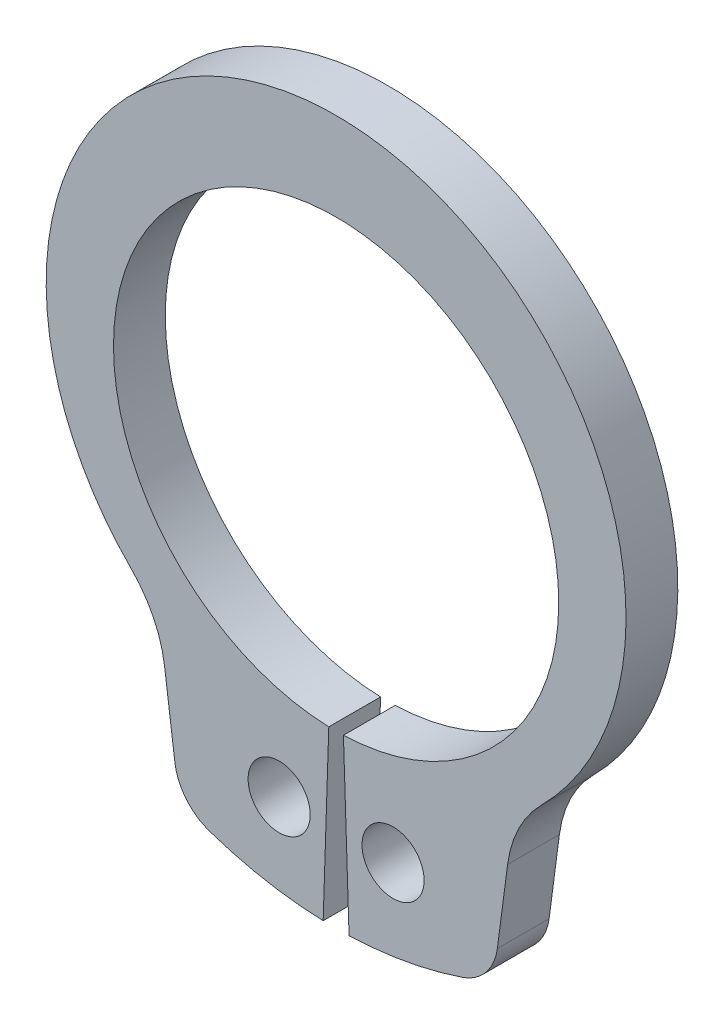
from build123d import *

# Parameters (mm, degrees)
BODYSKE_R  = 0.6
BODY_DEPTH = 1


with BuildPart() as part:
    # BodySke → Body (new body)
    with BuildSketch(Plane.XY):
        with BuildLine():
            Line((0.141447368, -4.297672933), (0.25, -7.595887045))
            ThreePointArc((0.25, -7.595887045), (1.361946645, -7.476971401), (2.444405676, -7.196171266))
            ThreePointArc((2.444405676, -7.196171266), (2.895848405, -6.883621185), (3.114218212, -6.379832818))
            Line((3.114218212, -6.379832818), (3.312698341, -4.872226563))
            ThreePointArc((3.312698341, -4.872226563), (3.528053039, -4.162221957), (3.960166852, -3.559095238))
            ThreePointArc((3.960166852, -3.559095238), (0, 6), (-3.960166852, -3.559095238))
            ThreePointArc((-3.960166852, -3.559095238), (-3.528053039, -4.162221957), (-3.312698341, -4.872226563))
            Line((-3.312698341, -4.872226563), (-3.114218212, -6.379832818))
            ThreePointArc((-3.114218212, -6.379832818), (-2.895848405, -6.883621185), (-2.444405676, -7.196171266))
            ThreePointArc((-2.444405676, -7.196171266), (-1.361946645, -7.476971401), (-0.25, -7.595887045))
            Line((-0.25, -7.595887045), (-0.141447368, -4.297672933))
            ThreePointArc((-0.141447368, -4.297672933), (0, 4.3), (0.141447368, -4.297672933))
        make_face()
        with Locations((1.1, -5.949159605)):
            Circle(BODYSKE_R, mode=Mode.SUBTRACT)
        with Locations((-1.1, -5.949159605)):
            Circle(BODYSKE_R, mode=Mode.SUBTRACT)
    extrude(amount=-BODY_DEPTH)


solid = part.part
